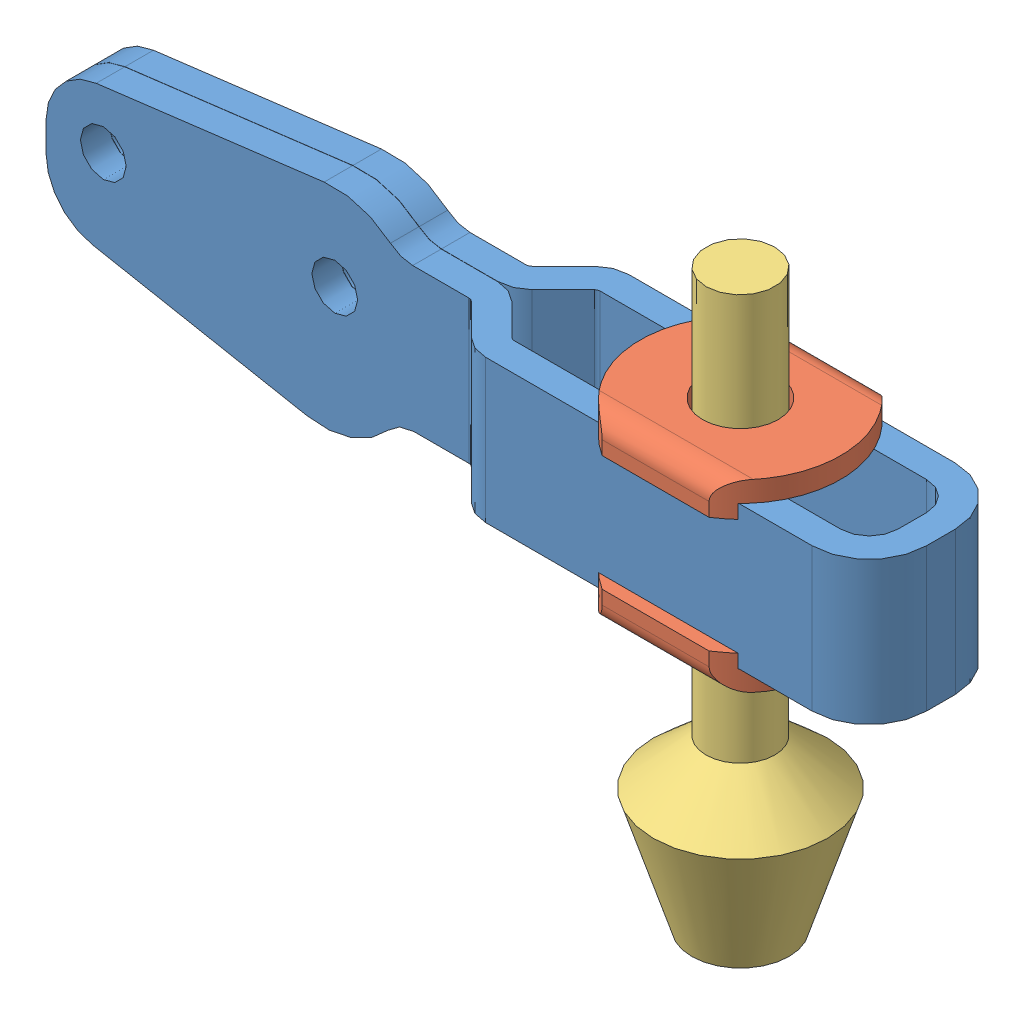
SolidWorks assembly hold-down sub-assy_&.SLDASM, configuration Default (file format 3100). Lengths in mm.
Overall size (96.01 63.5 19.3).
4 component instances, 3 part files, 10 mates.
Components (placement in the parent):
- arm_&-1: arm_&.SLDPRT [Default] at origin size (96.01 23.62 15.88)
- washer_&-1: washer_&.SLDPRT [Default] at (73.787 -2.286 0) x (0 0 -1) z (1 0 0) size (18.8 3.81 22.23)
- washer_&-2: washer_&.SLDPRT [Default] at (73.787 18.161 0) x (0 0 -1) z (-1 0 0) size (18.8 3.81 22.23)
- hold-down bolt_&-1: hold-down bolt_&.sldprt [Default] at (73.787 -32.766 0) size (19.3 63.5 19.3)
Mates (geometry in assembly coordinates):
- Parallel1: parallel anti-aligned: line of arm_&-1; line of washer_&-1
- Coincident1: coincident anti-aligned: plane of arm_&-1; plane of washer_&-1
- Distance1: distance = 0.0635 mm anti-aligned: plane of arm_&-1; plane of washer_&-1
- Coincident2: coincident anti-aligned: plane of arm_&-1; plane of washer_&-2
- Distance2: distance = 19.05 mm anti-aligned: plane of arm_&-1; plane of hold-down bolt_&-1
- Concentric1: concentric anti-aligned: cylinder of washer_&-1; cylinder of washer_&-2
- Parallel2: parallel: line of washer_&-1; plane of washer_&-2
- Distance3: distance = 30.48 mm aligned: plane of washer_&-1; plane of hold-down bolt_&-1
- Parallel3: parallel anti-aligned: plane of washer_&-2; plane of hold-down bolt_&-1
- Concentric2: concentric anti-aligned: cylinder of washer_&-2; cylinder of hold-down bolt_&-1
